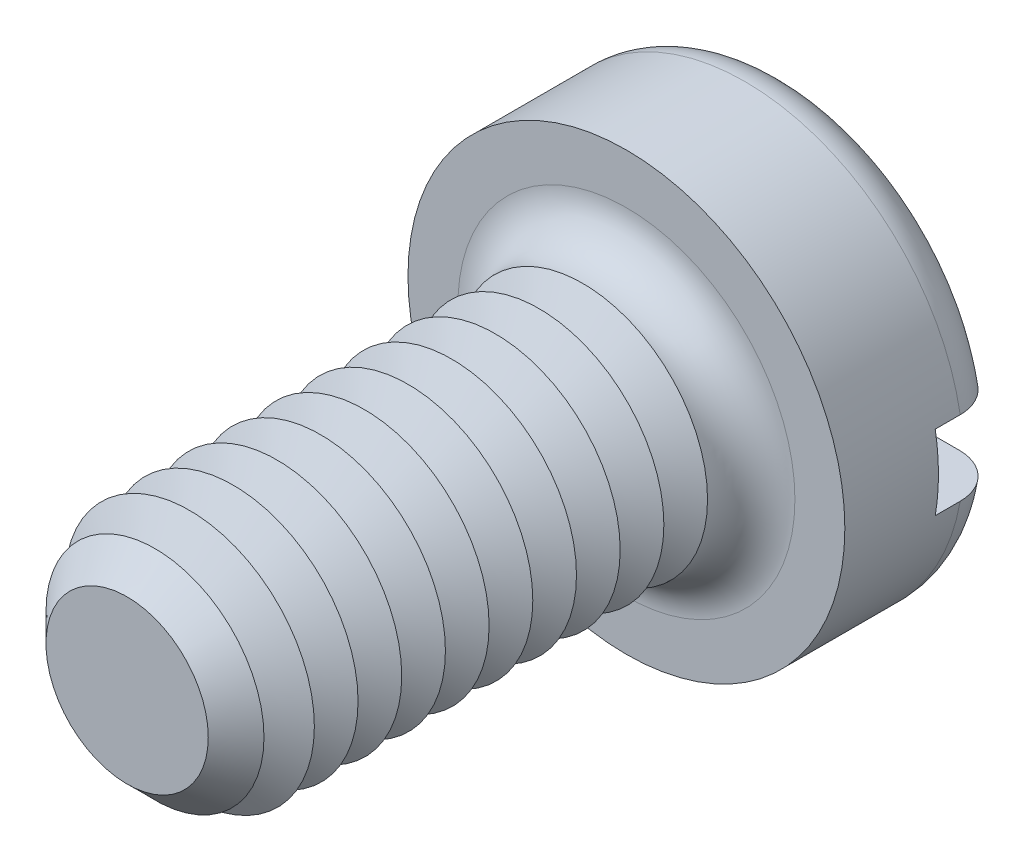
from build123d import *

# Parameters (mm, degrees)
SKETCH3_R           = 3.5
BOSS_EXTRUDE2_DEPTH = 2.6
SKETCH4_R           = 2
BOSS_EXTRUDE3_DEPTH = 8
FILLET1_R           = 0.7
CHAMFER1_SIZE       = 0.7
LPATTERN1_COUNT     = 10
LPATTERN1_PITCH     = 0.7
SKETCH8_W           = 7
SKETCH8_H           = 1.2
CUT_EXTRUDE1_DEPTH  = 1.1


with BuildPart() as part:
    # Sketch3 → Boss-Extrude2 (new body)
    with BuildSketch(Plane.XY):
        Circle(SKETCH3_R)
    extrude(amount=-BOSS_EXTRUDE2_DEPTH)

    # Sketch4 → Boss-Extrude3 (add)
    with BuildSketch(Plane.XY):
        Circle(SKETCH4_R)
    extrude(amount=BOSS_EXTRUDE3_DEPTH)

    # Fillet1
    fillet1_edges = [part.edges().sort_by_distance(p)[0] for p in [
        (-3.5, 0, -2.6),
        (-2, 0, 0),
    ]]
    fillet(fillet1_edges, radius=FILLET1_R)

    # Chamfer1
    chamfer1_edges = [part.edges().sort_by_distance(p)[0] for p in [
        (-2, 0, 8),
    ]]
    chamfer(chamfer1_edges, length=CHAMFER1_SIZE)

    # Sketch6 → Cut-Revolve1 (revolve, cut)
    with BuildSketch(Plane(origin=(0, 0, 0), x_dir=(0, 0, -1), z_dir=(1, 0, 0)), mode=Mode.PRIVATE) as cut_revolve1_sk:
        Polygon((-0.7, 2), (-1.05, 1.393782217), (-1.4, 2), align=None)
    cut_revolve1 = revolve(cut_revolve1_sk.sketch.rotate(Axis((0, 0, -1.694361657), (0, 0, 1)), 90), axis=Axis((0, 0, -1.694361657), (0, 0, 1)), mode=Mode.SUBTRACT)

    # LPattern1: Cut-Revolve1 ×10
    with Locations(*[(0, 0, i * LPATTERN1_PITCH) for i in range(1, LPATTERN1_COUNT)]):
        add(cut_revolve1, mode=Mode.SUBTRACT)

    # Sketch8 → Cut-Extrude1 (cut)
    with BuildSketch(Plane(origin=(0, 0, -2.6), x_dir=(-1, 0, 0), z_dir=(0, 0, -1))):
        Rectangle(SKETCH8_W, SKETCH8_H)
    extrude(amount=-CUT_EXTRUDE1_DEPTH, mode=Mode.SUBTRACT)


solid = part.part
